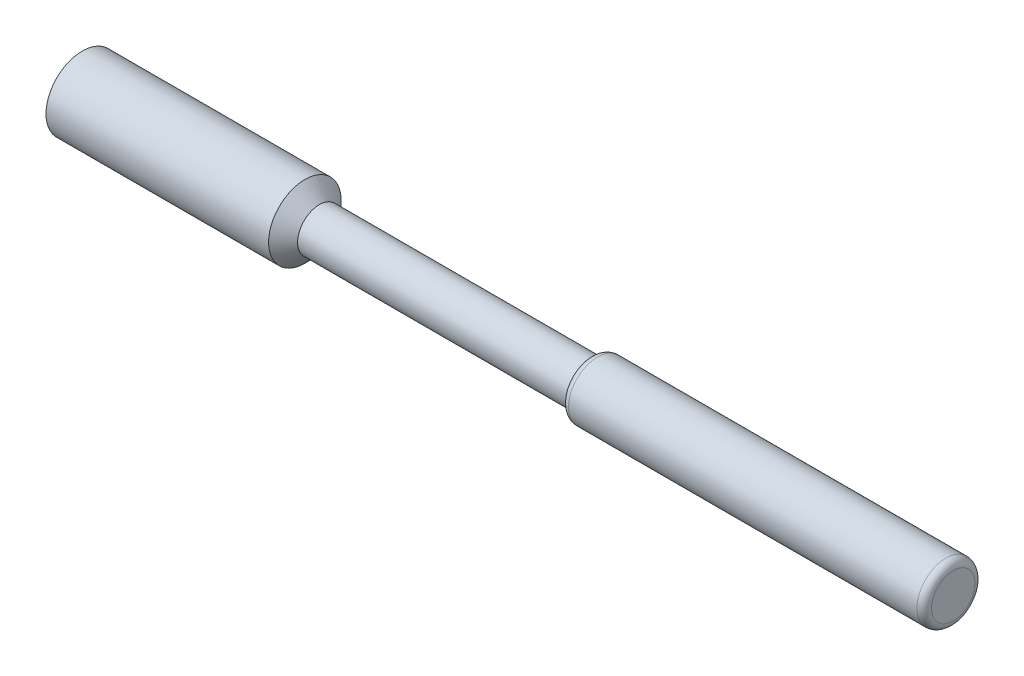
ISO-10303-21;
HEADER;
FILE_DESCRIPTION(('STEP AP214'),'2;1');
FILE_NAME('part.step','',(''),(''),'','','');
FILE_SCHEMA(('AUTOMOTIVE_DESIGN { 1 0 10303 214 1 1 1 1 }'));
ENDSEC;
DATA;
#1=APPLICATION_CONTEXT('core data for automotive mechanical design processes');
#2=APPLICATION_PROTOCOL_DEFINITION('international standard','automotive_design',2000,#1);
#3=PRODUCT_CONTEXT('',#1,'mechanical');
#4=PRODUCT('Part','Part','',(#3));
#5=PRODUCT_RELATED_PRODUCT_CATEGORY('part','',(#4));
#6=PRODUCT_DEFINITION_FORMATION('','',#4);
#7=PRODUCT_DEFINITION_CONTEXT('part definition',#1,'design');
#8=PRODUCT_DEFINITION('design','',#6,#7);
#9=PRODUCT_DEFINITION_SHAPE('','',#8);
#10=(LENGTH_UNIT() NAMED_UNIT(*) SI_UNIT(.MILLI.,.METRE.));
#11=(NAMED_UNIT(*) PLANE_ANGLE_UNIT() SI_UNIT($,.RADIAN.));
#12=(NAMED_UNIT(*) SI_UNIT($,.STERADIAN.) SOLID_ANGLE_UNIT());
#13=UNCERTAINTY_MEASURE_WITH_UNIT(LENGTH_MEASURE(1.E-05),#10,'distance_accuracy_value','');
#14=(GEOMETRIC_REPRESENTATION_CONTEXT(3) GLOBAL_UNCERTAINTY_ASSIGNED_CONTEXT((#13)) GLOBAL_UNIT_ASSIGNED_CONTEXT((#10,
#11,#12)) REPRESENTATION_CONTEXT('',''));
#15=CARTESIAN_POINT('',(0.,0.,0.));
#16=DIRECTION('',(0.,0.,1.));
#17=DIRECTION('',(1.,0.,0.));
#18=AXIS2_PLACEMENT_3D('',#15,#16,#17);
#19=CARTESIAN_POINT('',(45.,0.,0.));
#20=DIRECTION('',(-1.,0.,0.));
#21=DIRECTION('',(0.,0.,1.));
#22=AXIS2_PLACEMENT_3D('',#19,#20,#21);
#23=CYLINDRICAL_SURFACE('',#22,7.5);
#24=CARTESIAN_POINT('',(46.,0.,0.));
#25=DIRECTION('',(-1.,0.,0.));
#26=DIRECTION('',(0.,0.,1.));
#27=AXIS2_PLACEMENT_3D('',#24,#25,#26);
#28=CIRCLE('',#27,7.5);
#29=CARTESIAN_POINT('',(46.,0.,7.5));
#30=VERTEX_POINT('',#29);
#31=EDGE_CURVE('E10',#30,#30,#28,.T.);
#32=CARTESIAN_POINT('',(0.,0.,0.));
#33=DIRECTION('',(1.,0.,0.));
#34=DIRECTION('',(0.,0.,-1.));
#35=AXIS2_PLACEMENT_3D('',#32,#33,#34);
#36=CIRCLE('',#35,7.5);
#37=CARTESIAN_POINT('',(0.,0.,7.5));
#38=VERTEX_POINT('',#37);
#39=EDGE_CURVE('E70',#38,#38,#36,.T.);
#40=CARTESIAN_POINT('',(46.,0.,7.5));
#41=CARTESIAN_POINT('',(45.5208333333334,0.,7.5));
#42=CARTESIAN_POINT('',(45.0416666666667,0.,7.5));
#43=CARTESIAN_POINT('',(44.0833333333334,0.,7.5));
#44=CARTESIAN_POINT('',(43.6041666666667,0.,7.5));
#45=CARTESIAN_POINT('',(42.6458333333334,0.,7.5));
#46=CARTESIAN_POINT('',(42.1666666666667,0.,7.5));
#47=CARTESIAN_POINT('',(41.2083333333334,0.,7.5));
#48=CARTESIAN_POINT('',(40.7291666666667,0.,7.5));
#49=CARTESIAN_POINT('',(39.7708333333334,0.,7.5));
#50=CARTESIAN_POINT('',(39.2916666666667,0.,7.5));
#51=CARTESIAN_POINT('',(38.3333333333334,0.,7.5));
#52=CARTESIAN_POINT('',(37.8541666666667,0.,7.5));
#53=CARTESIAN_POINT('',(36.8958333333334,0.,7.5));
#54=CARTESIAN_POINT('',(36.4166666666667,0.,7.5));
#55=CARTESIAN_POINT('',(35.4583333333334,0.,7.5));
#56=CARTESIAN_POINT('',(34.9791666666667,0.,7.5));
#57=CARTESIAN_POINT('',(34.0208333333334,0.,7.5));
#58=CARTESIAN_POINT('',(33.5416666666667,0.,7.5));
#59=CARTESIAN_POINT('',(32.5833333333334,0.,7.5));
#60=CARTESIAN_POINT('',(32.1041666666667,0.,7.5));
#61=CARTESIAN_POINT('',(31.1458333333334,0.,7.5));
#62=CARTESIAN_POINT('',(30.6666666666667,0.,7.5));
#63=CARTESIAN_POINT('',(29.7083333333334,0.,7.5));
#64=CARTESIAN_POINT('',(29.2291666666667,0.,7.5));
#65=CARTESIAN_POINT('',(28.2708333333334,0.,7.5));
#66=CARTESIAN_POINT('',(27.7916666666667,0.,7.5));
#67=CARTESIAN_POINT('',(26.8333333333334,0.,7.5));
#68=CARTESIAN_POINT('',(26.3541666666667,0.,7.5));
#69=CARTESIAN_POINT('',(25.3958333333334,0.,7.5));
#70=CARTESIAN_POINT('',(24.9166666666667,0.,7.5));
#71=CARTESIAN_POINT('',(23.9583333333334,0.,7.5));
#72=CARTESIAN_POINT('',(23.4791666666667,0.,7.5));
#73=CARTESIAN_POINT('',(22.5208333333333,0.,7.5));
#74=CARTESIAN_POINT('',(22.0416666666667,0.,7.5));
#75=CARTESIAN_POINT('',(21.0833333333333,0.,7.5));
#76=CARTESIAN_POINT('',(20.6041666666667,0.,7.5));
#77=CARTESIAN_POINT('',(19.6458333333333,0.,7.5));
#78=CARTESIAN_POINT('',(19.1666666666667,0.,7.5));
#79=CARTESIAN_POINT('',(18.2083333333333,0.,7.5));
#80=CARTESIAN_POINT('',(17.7291666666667,0.,7.5));
#81=CARTESIAN_POINT('',(16.7708333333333,0.,7.5));
#82=CARTESIAN_POINT('',(16.2916666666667,0.,7.5));
#83=CARTESIAN_POINT('',(15.3333333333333,0.,7.5));
#84=CARTESIAN_POINT('',(14.8541666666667,0.,7.5));
#85=CARTESIAN_POINT('',(13.8958333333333,0.,7.5));
#86=CARTESIAN_POINT('',(13.4166666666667,0.,7.5));
#87=CARTESIAN_POINT('',(12.4583333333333,0.,7.5));
#88=CARTESIAN_POINT('',(11.9791666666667,0.,7.5));
#89=CARTESIAN_POINT('',(11.0208333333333,0.,7.5));
#90=CARTESIAN_POINT('',(10.5416666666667,0.,7.5));
#91=CARTESIAN_POINT('',(9.58333333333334,0.,7.5));
#92=CARTESIAN_POINT('',(9.10416666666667,0.,7.5));
#93=CARTESIAN_POINT('',(8.14583333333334,0.,7.5));
#94=CARTESIAN_POINT('',(7.66666666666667,0.,7.5));
#95=CARTESIAN_POINT('',(6.70833333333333,0.,7.5));
#96=CARTESIAN_POINT('',(6.22916666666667,0.,7.5));
#97=CARTESIAN_POINT('',(5.27083333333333,0.,7.5));
#98=CARTESIAN_POINT('',(4.79166666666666,0.,7.5));
#99=CARTESIAN_POINT('',(3.83333333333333,0.,7.5));
#100=CARTESIAN_POINT('',(3.35416666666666,0.,7.5));
#101=CARTESIAN_POINT('',(2.39583333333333,0.,7.5));
#102=CARTESIAN_POINT('',(1.91666666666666,0.,7.5));
#103=CARTESIAN_POINT('',(0.958333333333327,0.,7.5));
#104=CARTESIAN_POINT('',(0.47916666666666,0.,7.5));
#105=CARTESIAN_POINT('',(0.,0.,7.5));
#106=B_SPLINE_CURVE_WITH_KNOTS('',3,(#40,#41,#42,#43,#44,#45,#46,#47,#48,#49,#50,#51,#52,#53,
#54,#55,#56,#57,#58,#59,#60,#61,#62,#63,#64,#65,#66,#67,#68,#69,#70,#71,#72,#73,#74,#75,#76,#77,
#78,#79,#80,#81,#82,#83,#84,#85,#86,#87,#88,#89,#90,#91,#92,#93,#94,#95,#96,#97,#98,#99,#100,
#101,#102,#103,#104,#105),.UNSPECIFIED.,.F.,.F.,(4,2,2,2,2,2,2,2,2,2,2,2,2,2,2,2,2,2,2,2,2,2,2,
2,2,2,2,2,2,2,2,2,4),(0.,1.43750000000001,2.87500000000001,4.31250000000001,5.75000000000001,
7.18750000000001,8.62500000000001,10.0625,11.5,12.9375,14.375,15.8125,17.25,18.6875,20.125,
21.5625,23.,24.4375,25.875,27.3125,28.75,30.1875,31.625,33.0625,34.5,35.9375,37.375,38.8125,
40.25,41.6875,43.125,44.5625000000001,46.0000000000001),.UNSPECIFIED.);
#107=EDGE_CURVE('BSEAM43',#30,#38,#106,.T.);
#108=ORIENTED_EDGE('',*,*,#31,.T.);
#109=ORIENTED_EDGE('',*,*,#39,.T.);
#110=ORIENTED_EDGE('',*,*,#107,.T.);
#111=ORIENTED_EDGE('',*,*,#107,.F.);
#112=EDGE_LOOP('',(#108,#110,#109,#111));
#113=FACE_BOUND('',#112,.T.);
#114=ADVANCED_FACE('F43',(#113),#23,.T.);
#115=CARTESIAN_POINT('',(0.,0.,0.));
#116=DIRECTION('',(1.,0.,0.));
#117=DIRECTION('',(0.,0.,-1.));
#118=AXIS2_PLACEMENT_3D('',#115,#116,#117);
#119=PLANE('',#118);
#120=ORIENTED_EDGE('',*,*,#39,.F.);
#121=EDGE_LOOP('',(#120));
#122=FACE_BOUND('',#121,.T.);
#123=ADVANCED_FACE('F83',(#122),#119,.F.);
#124=CARTESIAN_POINT('',(105.,0.,0.));
#125=DIRECTION('',(-1.,0.,0.));
#126=DIRECTION('',(0.,0.,1.));
#127=AXIS2_PLACEMENT_3D('',#124,#125,#126);
#128=CYLINDRICAL_SURFACE('',#127,4.5);
#129=CARTESIAN_POINT('',(49.0000000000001,0.,0.));
#130=DIRECTION('',(1.,0.,0.));
#131=DIRECTION('',(0.,0.,-1.));
#132=AXIS2_PLACEMENT_3D('',#129,#130,#131);
#133=CIRCLE('',#132,4.5);
#134=CARTESIAN_POINT('',(49.0000000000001,0.,-4.5));
#135=VERTEX_POINT('',#134);
#136=EDGE_CURVE('E52',#135,#135,#133,.T.);
#137=ORIENTED_EDGE('',*,*,#136,.T.);
#138=EDGE_LOOP('',(#137));
#139=FACE_BOUND('',#138,.T.);
#140=CARTESIAN_POINT('',(105.,0.,0.));
#141=DIRECTION('',(1.,0.,0.));
#142=DIRECTION('',(0.,0.,-1.));
#143=AXIS2_PLACEMENT_3D('',#140,#141,#142);
#144=CIRCLE('',#143,4.5);
#145=CARTESIAN_POINT('',(105.,0.,-4.5));
#146=VERTEX_POINT('',#145);
#147=EDGE_CURVE('E73',#146,#146,#144,.T.);
#148=ORIENTED_EDGE('',*,*,#147,.F.);
#149=EDGE_LOOP('',(#148));
#150=FACE_BOUND('',#149,.T.);
#151=ADVANCED_FACE('F80',(#139,#150),#128,.T.);
#152=CARTESIAN_POINT('',(180.,0.,0.));
#153=DIRECTION('',(-1.,0.,0.));
#154=DIRECTION('',(0.,0.,1.));
#155=AXIS2_PLACEMENT_3D('',#152,#153,#154);
#156=CYLINDRICAL_SURFACE('',#155,6.);
#157=CARTESIAN_POINT('',(178.5,0.,0.));
#158=DIRECTION('',(1.,0.,0.));
#159=DIRECTION('',(0.,0.,-1.));
#160=AXIS2_PLACEMENT_3D('',#157,#158,#159);
#161=CIRCLE('',#160,6.);
#162=CARTESIAN_POINT('',(178.5,0.,-6.));
#163=VERTEX_POINT('',#162);
#164=EDGE_CURVE('E57',#163,#163,#161,.F.);
#165=ORIENTED_EDGE('',*,*,#164,.T.);
#166=EDGE_LOOP('',(#165));
#167=FACE_BOUND('',#166,.T.);
#168=CARTESIAN_POINT('',(106.5,0.,0.));
#169=DIRECTION('',(1.,0.,0.));
#170=DIRECTION('',(0.,0.,-1.));
#171=AXIS2_PLACEMENT_3D('',#168,#169,#170);
#172=CIRCLE('',#171,6.);
#173=CARTESIAN_POINT('',(106.5,0.,-6.));
#174=VERTEX_POINT('',#173);
#175=EDGE_CURVE('E62',#174,#174,#172,.T.);
#176=ORIENTED_EDGE('',*,*,#175,.T.);
#177=EDGE_LOOP('',(#176));
#178=FACE_BOUND('',#177,.T.);
#179=ADVANCED_FACE('F82',(#167,#178),#156,.T.);
#180=CARTESIAN_POINT('',(180.,0.,0.));
#181=DIRECTION('',(1.,0.,0.));
#182=DIRECTION('',(0.,0.,-1.));
#183=AXIS2_PLACEMENT_3D('',#180,#181,#182);
#184=PLANE('',#183);
#185=CARTESIAN_POINT('',(180.,0.,0.));
#186=DIRECTION('',(1.,0.,0.));
#187=DIRECTION('',(0.,0.,-1.));
#188=AXIS2_PLACEMENT_3D('',#185,#186,#187);
#189=CIRCLE('',#188,4.5);
#190=CARTESIAN_POINT('',(180.,0.,-4.5));
#191=VERTEX_POINT('',#190);
#192=EDGE_CURVE('E67',#191,#191,#189,.T.);
#193=ORIENTED_EDGE('',*,*,#192,.T.);
#194=EDGE_LOOP('',(#193));
#195=FACE_BOUND('',#194,.T.);
#196=ADVANCED_FACE('F90',(#195),#184,.T.);
#197=CARTESIAN_POINT('',(178.5,0.,0.));
#198=DIRECTION('',(1.,0.,0.));
#199=DIRECTION('',(0.,0.,-1.));
#200=AXIS2_PLACEMENT_3D('',#197,#198,#199);
#201=TOROIDAL_SURFACE('',#200,4.5,1.5);
#202=ORIENTED_EDGE('',*,*,#164,.F.);
#203=EDGE_LOOP('',(#202));
#204=FACE_BOUND('',#203,.T.);
#205=ORIENTED_EDGE('',*,*,#192,.F.);
#206=EDGE_LOOP('',(#205));
#207=FACE_BOUND('',#206,.T.);
#208=ADVANCED_FACE('F102',(#204,#207),#201,.T.);
#209=CARTESIAN_POINT('',(106.5,0.,0.));
#210=DIRECTION('',(1.,0.,0.));
#211=DIRECTION('',(0.,0.,-1.));
#212=AXIS2_PLACEMENT_3D('',#209,#210,#211);
#213=TOROIDAL_SURFACE('',#212,4.5,1.5);
#214=ORIENTED_EDGE('',*,*,#147,.T.);
#215=EDGE_LOOP('',(#214));
#216=FACE_BOUND('',#215,.T.);
#217=ORIENTED_EDGE('',*,*,#175,.F.);
#218=EDGE_LOOP('',(#217));
#219=FACE_BOUND('',#218,.T.);
#220=ADVANCED_FACE('F77',(#216,#219),#213,.T.);
#221=CARTESIAN_POINT('',(49.0000000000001,0.,0.));
#222=DIRECTION('',(-1.,0.,0.));
#223=DIRECTION('',(0.,0.,1.));
#224=AXIS2_PLACEMENT_3D('',#221,#222,#223);
#225=CONICAL_SURFACE('',#224,4.5,0.785398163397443);
#226=ORIENTED_EDGE('',*,*,#31,.F.);
#227=EDGE_LOOP('',(#226));
#228=FACE_BOUND('',#227,.T.);
#229=ORIENTED_EDGE('',*,*,#136,.F.);
#230=EDGE_LOOP('',(#229));
#231=FACE_BOUND('',#230,.T.);
#232=ADVANCED_FACE('F46',(#228,#231),#225,.T.);
#233=CLOSED_SHELL('',(#114,#123,#151,#179,#196,#208,#220,#232));
#234=MANIFOLD_SOLID_BREP('B2',#233);
#235=ADVANCED_BREP_SHAPE_REPRESENTATION('',(#18,#234),#14);
#236=SHAPE_DEFINITION_REPRESENTATION(#9,#235);
ENDSEC;
END-ISO-10303-21;
